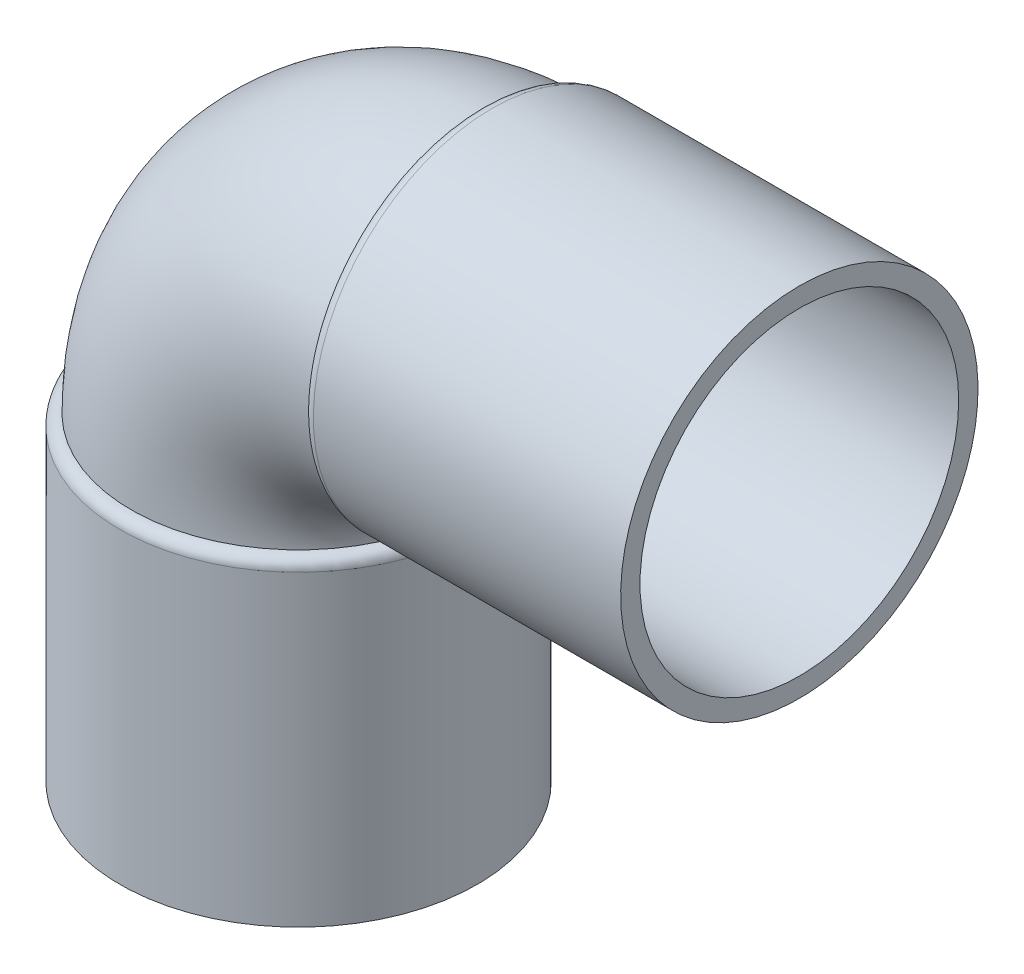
ISO-10303-21;
HEADER;
FILE_DESCRIPTION(('STEP AP214'),'2;1');
FILE_NAME('part.step','',(''),(''),'','','');
FILE_SCHEMA(('AUTOMOTIVE_DESIGN { 1 0 10303 214 1 1 1 1 }'));
ENDSEC;
DATA;
#1=APPLICATION_CONTEXT('core data for automotive mechanical design processes');
#2=APPLICATION_PROTOCOL_DEFINITION('international standard','automotive_design',2000,#1);
#3=PRODUCT_CONTEXT('',#1,'mechanical');
#4=PRODUCT('Part','Part','',(#3));
#5=PRODUCT_RELATED_PRODUCT_CATEGORY('part','',(#4));
#6=PRODUCT_DEFINITION_FORMATION('','',#4);
#7=PRODUCT_DEFINITION_CONTEXT('part definition',#1,'design');
#8=PRODUCT_DEFINITION('design','',#6,#7);
#9=PRODUCT_DEFINITION_SHAPE('','',#8);
#10=(LENGTH_UNIT() NAMED_UNIT(*) SI_UNIT(.MILLI.,.METRE.));
#11=(NAMED_UNIT(*) PLANE_ANGLE_UNIT() SI_UNIT($,.RADIAN.));
#12=(NAMED_UNIT(*) SI_UNIT($,.STERADIAN.) SOLID_ANGLE_UNIT());
#13=UNCERTAINTY_MEASURE_WITH_UNIT(LENGTH_MEASURE(1.E-05),#10,'distance_accuracy_value','');
#14=(GEOMETRIC_REPRESENTATION_CONTEXT(3) GLOBAL_UNCERTAINTY_ASSIGNED_CONTEXT((#13)) GLOBAL_UNIT_ASSIGNED_CONTEXT((#10,
#11,#12)) REPRESENTATION_CONTEXT('',''));
#15=CARTESIAN_POINT('',(0.,0.,0.));
#16=DIRECTION('',(0.,0.,1.));
#17=DIRECTION('',(1.,0.,0.));
#18=AXIS2_PLACEMENT_3D('',#15,#16,#17);
#19=CARTESIAN_POINT('',(22.,22.,0.));
#20=DIRECTION('',(1.,0.,0.));
#21=DIRECTION('',(0.,0.,1.));
#22=AXIS2_PLACEMENT_3D('',#19,#20,#21);
#23=PLANE('',#22);
#24=CARTESIAN_POINT('',(22.,22.,0.));
#25=DIRECTION('',(-1.,0.,0.));
#26=DIRECTION('',(0.,0.,-1.));
#27=AXIS2_PLACEMENT_3D('',#24,#25,#26);
#28=CIRCLE('',#27,7.);
#29=CARTESIAN_POINT('',(22.,22.,-7.));
#30=VERTEX_POINT('',#29);
#31=EDGE_CURVE('E39',#30,#30,#28,.T.);
#32=ORIENTED_EDGE('',*,*,#31,.T.);
#33=EDGE_LOOP('',(#32));
#34=FACE_BOUND('',#33,.T.);
#35=CARTESIAN_POINT('',(22.,22.,0.));
#36=DIRECTION('',(1.,0.,0.));
#37=DIRECTION('',(0.,1.,0.));
#38=AXIS2_PLACEMENT_3D('',#35,#36,#37);
#39=CIRCLE('',#38,7.85);
#40=CARTESIAN_POINT('',(22.,29.85,0.));
#41=VERTEX_POINT('',#40);
#42=EDGE_CURVE('E59',#41,#41,#39,.T.);
#43=ORIENTED_EDGE('',*,*,#42,.T.);
#44=EDGE_LOOP('',(#43));
#45=FACE_BOUND('',#44,.T.);
#46=ADVANCED_FACE('F24',(#34,#45),#23,.T.);
#47=CARTESIAN_POINT('',(8.,14.,0.));
#48=DIRECTION('',(0.,0.,-1.));
#49=DIRECTION('',(-1.,0.,0.));
#50=AXIS2_PLACEMENT_3D('',#47,#48,#49);
#51=TOROIDAL_SURFACE('',#50,8.,7.35);
#52=CARTESIAN_POINT('',(0.,14.,0.));
#53=DIRECTION('',(0.,-1.,0.));
#54=DIRECTION('',(0.,0.,-1.));
#55=AXIS2_PLACEMENT_3D('',#52,#53,#54);
#56=CIRCLE('',#55,7.35);
#57=CARTESIAN_POINT('',(-7.35,14.,0.));
#58=VERTEX_POINT('',#57);
#59=EDGE_CURVE('E53',#58,#58,#56,.T.);
#60=CARTESIAN_POINT('',(8.,22.,0.));
#61=DIRECTION('',(1.,0.,0.));
#62=DIRECTION('',(0.,0.,1.));
#63=AXIS2_PLACEMENT_3D('',#60,#61,#62);
#64=CIRCLE('',#63,7.35);
#65=CARTESIAN_POINT('',(7.99999999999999,29.35,0.));
#66=VERTEX_POINT('',#65);
#67=EDGE_CURVE('E35',#66,#66,#64,.T.);
#68=CARTESIAN_POINT('',(8.,14.,0.));
#69=DIRECTION('',(0.,0.,-1.));
#70=DIRECTION('',(-1.,0.,0.));
#71=AXIS2_PLACEMENT_3D('',#68,#69,#70);
#72=CIRCLE('',#71,15.35);
#73=EDGE_CURVE('',#58,#66,#72,.T.);
#74=ORIENTED_EDGE('',*,*,#59,.F.);
#75=ORIENTED_EDGE('',*,*,#67,.F.);
#76=ORIENTED_EDGE('',*,*,#73,.T.);
#77=ORIENTED_EDGE('',*,*,#73,.F.);
#78=EDGE_LOOP('',(#74,#76,#75,#77));
#79=FACE_BOUND('',#78,.T.);
#80=ADVANCED_FACE('F26',(#79),#51,.T.);
#81=CARTESIAN_POINT('',(0.,0.,0.));
#82=DIRECTION('',(0.,1.,0.));
#83=DIRECTION('',(0.,0.,1.));
#84=AXIS2_PLACEMENT_3D('',#81,#82,#83);
#85=PLANE('',#84);
#86=CARTESIAN_POINT('',(0.,0.,0.));
#87=DIRECTION('',(0.,-1.,0.));
#88=DIRECTION('',(0.,0.,-1.));
#89=AXIS2_PLACEMENT_3D('',#86,#87,#88);
#90=CIRCLE('',#89,7.);
#91=CARTESIAN_POINT('',(0.,0.,-7.));
#92=VERTEX_POINT('',#91);
#93=EDGE_CURVE('E50',#92,#92,#90,.T.);
#94=ORIENTED_EDGE('',*,*,#93,.F.);
#95=EDGE_LOOP('',(#94));
#96=FACE_BOUND('',#95,.T.);
#97=CARTESIAN_POINT('',(0.,0.,0.));
#98=DIRECTION('',(0.,-1.,0.));
#99=DIRECTION('',(0.,0.,-1.));
#100=AXIS2_PLACEMENT_3D('',#97,#98,#99);
#101=CIRCLE('',#100,7.85);
#102=CARTESIAN_POINT('',(0.,0.,-7.85));
#103=VERTEX_POINT('',#102);
#104=EDGE_CURVE('E56',#103,#103,#101,.T.);
#105=ORIENTED_EDGE('',*,*,#104,.T.);
#106=EDGE_LOOP('',(#105));
#107=FACE_BOUND('',#106,.T.);
#108=ADVANCED_FACE('F85',(#96,#107),#85,.F.);
#109=CARTESIAN_POINT('',(8.,22.,0.));
#110=DIRECTION('',(1.,0.,0.));
#111=DIRECTION('',(0.,0.,-1.));
#112=AXIS2_PLACEMENT_3D('',#109,#110,#111);
#113=CYLINDRICAL_SURFACE('',#112,7.);
#114=CARTESIAN_POINT('',(8.,22.,0.));
#115=DIRECTION('',(-1.,0.,0.));
#116=DIRECTION('',(0.,0.,-1.));
#117=AXIS2_PLACEMENT_3D('',#114,#115,#116);
#118=CIRCLE('',#117,7.);
#119=CARTESIAN_POINT('',(7.99999999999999,29.,0.));
#120=VERTEX_POINT('',#119);
#121=EDGE_CURVE('E44',#120,#120,#118,.T.);
#122=ORIENTED_EDGE('',*,*,#121,.T.);
#123=EDGE_LOOP('',(#122));
#124=FACE_BOUND('',#123,.T.);
#125=ORIENTED_EDGE('',*,*,#31,.F.);
#126=EDGE_LOOP('',(#125));
#127=FACE_BOUND('',#126,.T.);
#128=ADVANCED_FACE('F90',(#124,#127),#113,.F.);
#129=CARTESIAN_POINT('',(8.,14.,0.));
#130=DIRECTION('',(0.,0.,-1.));
#131=DIRECTION('',(-1.,0.,0.));
#132=AXIS2_PLACEMENT_3D('',#129,#130,#131);
#133=TOROIDAL_SURFACE('',#132,8.,7.);
#134=CARTESIAN_POINT('',(0.,14.,0.));
#135=DIRECTION('',(0.,-1.,0.));
#136=DIRECTION('',(0.,0.,-1.));
#137=AXIS2_PLACEMENT_3D('',#134,#135,#136);
#138=CIRCLE('',#137,7.);
#139=CARTESIAN_POINT('',(-7.,14.,0.));
#140=VERTEX_POINT('',#139);
#141=EDGE_CURVE('E47',#140,#140,#138,.T.);
#142=CARTESIAN_POINT('',(8.,14.,0.));
#143=DIRECTION('',(0.,0.,-1.));
#144=DIRECTION('',(-1.,0.,0.));
#145=AXIS2_PLACEMENT_3D('',#142,#143,#144);
#146=CIRCLE('',#145,15.);
#147=EDGE_CURVE('',#140,#120,#146,.T.);
#148=ORIENTED_EDGE('',*,*,#141,.T.);
#149=ORIENTED_EDGE('',*,*,#121,.F.);
#150=ORIENTED_EDGE('',*,*,#147,.T.);
#151=ORIENTED_EDGE('',*,*,#147,.F.);
#152=EDGE_LOOP('',(#148,#150,#149,#151));
#153=FACE_BOUND('',#152,.T.);
#154=ADVANCED_FACE('F93',(#153),#133,.F.);
#155=CARTESIAN_POINT('',(0.,14.,0.));
#156=DIRECTION('',(0.,-1.,0.));
#157=DIRECTION('',(0.,0.,-1.));
#158=AXIS2_PLACEMENT_3D('',#155,#156,#157);
#159=CYLINDRICAL_SURFACE('',#158,7.);
#160=ORIENTED_EDGE('',*,*,#141,.F.);
#161=EDGE_LOOP('',(#160));
#162=FACE_BOUND('',#161,.T.);
#163=ORIENTED_EDGE('',*,*,#93,.T.);
#164=EDGE_LOOP('',(#163));
#165=FACE_BOUND('',#164,.T.);
#166=ADVANCED_FACE('F96',(#162,#165),#159,.F.);
#167=CARTESIAN_POINT('',(0.,14.,0.));
#168=DIRECTION('',(0.,-1.,0.));
#169=DIRECTION('',(0.,0.,-1.));
#170=AXIS2_PLACEMENT_3D('',#167,#168,#169);
#171=CYLINDRICAL_SURFACE('',#170,7.85);
#172=CARTESIAN_POINT('',(0.,13.5,0.));
#173=DIRECTION('',(0.,-1.,0.));
#174=DIRECTION('',(0.,0.,-1.));
#175=AXIS2_PLACEMENT_3D('',#172,#173,#174);
#176=CIRCLE('',#175,7.85);
#177=CARTESIAN_POINT('',(0.,13.5,-7.85));
#178=VERTEX_POINT('',#177);
#179=EDGE_CURVE('E31',#178,#178,#176,.T.);
#180=ORIENTED_EDGE('',*,*,#179,.T.);
#181=EDGE_LOOP('',(#180));
#182=FACE_BOUND('',#181,.T.);
#183=ORIENTED_EDGE('',*,*,#104,.F.);
#184=EDGE_LOOP('',(#183));
#185=FACE_BOUND('',#184,.T.);
#186=ADVANCED_FACE('F76',(#182,#185),#171,.T.);
#187=CARTESIAN_POINT('',(0.,13.5,0.));
#188=DIRECTION('',(0.,-1.,0.));
#189=DIRECTION('',(0.,0.,-1.));
#190=AXIS2_PLACEMENT_3D('',#187,#188,#189);
#191=TOROIDAL_SURFACE('',#190,7.35,0.5);
#192=ORIENTED_EDGE('',*,*,#59,.T.);
#193=EDGE_LOOP('',(#192));
#194=FACE_BOUND('',#193,.T.);
#195=ORIENTED_EDGE('',*,*,#179,.F.);
#196=EDGE_LOOP('',(#195));
#197=FACE_BOUND('',#196,.T.);
#198=ADVANCED_FACE('F67',(#194,#197),#191,.T.);
#199=CARTESIAN_POINT('',(8.,22.,0.));
#200=DIRECTION('',(1.,0.,0.));
#201=DIRECTION('',(0.,1.,0.));
#202=AXIS2_PLACEMENT_3D('',#199,#200,#201);
#203=CYLINDRICAL_SURFACE('',#202,7.85);
#204=CARTESIAN_POINT('',(8.5,22.,0.));
#205=DIRECTION('',(1.,0.,0.));
#206=DIRECTION('',(0.,1.,0.));
#207=AXIS2_PLACEMENT_3D('',#204,#205,#206);
#208=CIRCLE('',#207,7.85);
#209=CARTESIAN_POINT('',(8.5,29.85,0.));
#210=VERTEX_POINT('',#209);
#211=EDGE_CURVE('E10',#210,#210,#208,.T.);
#212=ORIENTED_EDGE('',*,*,#211,.T.);
#213=EDGE_LOOP('',(#212));
#214=FACE_BOUND('',#213,.T.);
#215=ORIENTED_EDGE('',*,*,#42,.F.);
#216=EDGE_LOOP('',(#215));
#217=FACE_BOUND('',#216,.T.);
#218=ADVANCED_FACE('F64',(#214,#217),#203,.T.);
#219=CARTESIAN_POINT('',(8.5,22.,0.));
#220=DIRECTION('',(1.,0.,0.));
#221=DIRECTION('',(0.,1.,0.));
#222=AXIS2_PLACEMENT_3D('',#219,#220,#221);
#223=TOROIDAL_SURFACE('',#222,7.35,0.5);
#224=ORIENTED_EDGE('',*,*,#67,.T.);
#225=EDGE_LOOP('',(#224));
#226=FACE_BOUND('',#225,.T.);
#227=ORIENTED_EDGE('',*,*,#211,.F.);
#228=EDGE_LOOP('',(#227));
#229=FACE_BOUND('',#228,.T.);
#230=ADVANCED_FACE('F66',(#226,#229),#223,.T.);
#231=CLOSED_SHELL('',(#46,#80,#108,#128,#154,#166,#186,#198,#218,#230));
#232=MANIFOLD_SOLID_BREP('B2',#231);
#233=ADVANCED_BREP_SHAPE_REPRESENTATION('',(#18,#232),#14);
#234=SHAPE_DEFINITION_REPRESENTATION(#9,#233);
ENDSEC;
END-ISO-10303-21;
